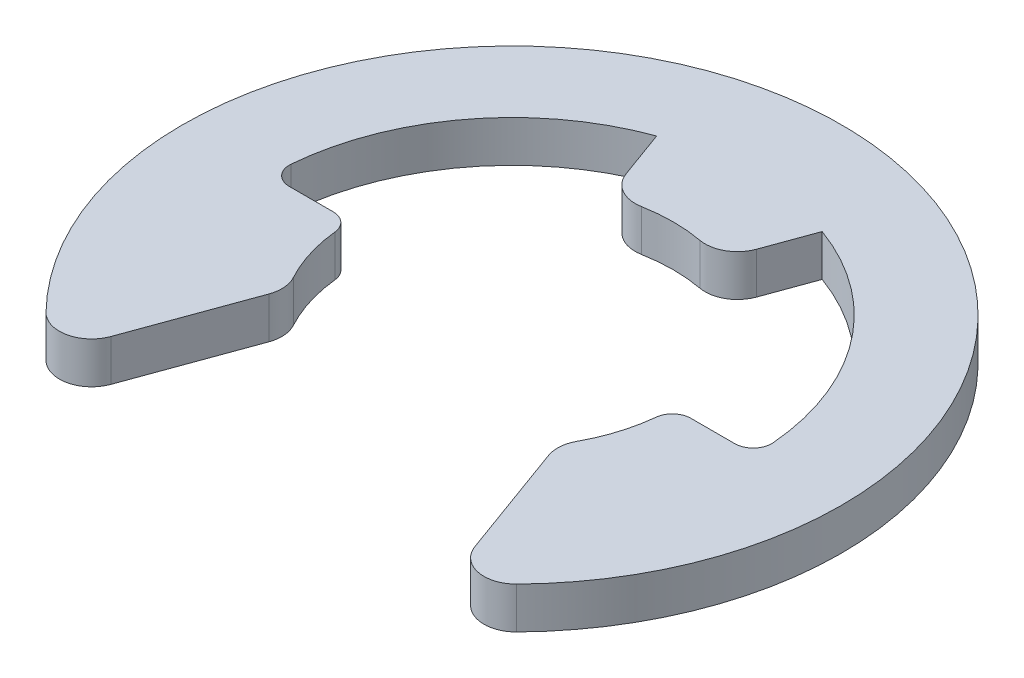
from build123d import *

# Parameters (mm, degrees)
BOSS_EXTRUDE1_DEPTH = 0.45
FILLET1_R           = 0.7
FILLET2_R           = 0.4


with BuildPart() as part:
    # Sketch2 → Boss-Extrude1 (new, symmetric)
    with BuildSketch(Plane(origin=(0, 0, 0), x_dir=(1, 0, 0), z_dir=(0, 1, 0))):
        with BuildLine():
            Line((-4.297515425, -5.714355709), (-2.92, -1.929663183))
            ThreePointArc((-2.92, -1.929663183), (-3.351865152, -1.007472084), (-3.5, 0))
            Line((-3.5, 0), (-5.25, 0))
            ThreePointArc((-5.25, 0), (-4.300548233, 3.011276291), (-1.795605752, 4.933386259))
            Line((-1.795605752, 4.933386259), (-1.197070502, 3.288924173))
            ThreePointArc((-1.197070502, 3.288924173), (0, 3.5), (1.197070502, 3.288924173))
            Line((1.197070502, 3.288924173), (1.795605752, 4.933386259))
            ThreePointArc((1.795605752, 4.933386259), (4.300548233, 3.011276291), (5.25, 0))
            Line((5.25, 0), (3.5, 0))
            ThreePointArc((3.5, 0), (3.351865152, -1.007472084), (2.92, -1.929663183))
            Line((2.92, -1.929663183), (4.297515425, -5.714355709))
            ThreePointArc((4.297515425, -5.714355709), (0, 7.15), (-4.297515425, -5.714355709))
        make_face()
    extrude(amount=BOSS_EXTRUDE1_DEPTH, both=True)

    # Fillet1
    fillet1_edges = [part.edges().sort_by_distance(p)[0] for p in [
        (-2.92, 0, 1.929663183),
        (-4.297515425, 0, 5.714355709),
        (4.297515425, 0, 5.714355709),
        (2.92, 0, 1.929663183),
        (1.197070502, 0, -3.288924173),
        (-1.197070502, 0, -3.288924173),
    ]]
    fillet(fillet1_edges, radius=FILLET1_R)

    # Fillet2
    fillet2_edges = [part.edges().sort_by_distance(p)[0] for p in [
        (-5.25, 0, 0),
        (-3.5, 0, 0),
        (3.5, 0, 0),
        (5.25, 0, 0),
    ]]
    fillet(fillet2_edges, radius=FILLET2_R)


solid = part.part
